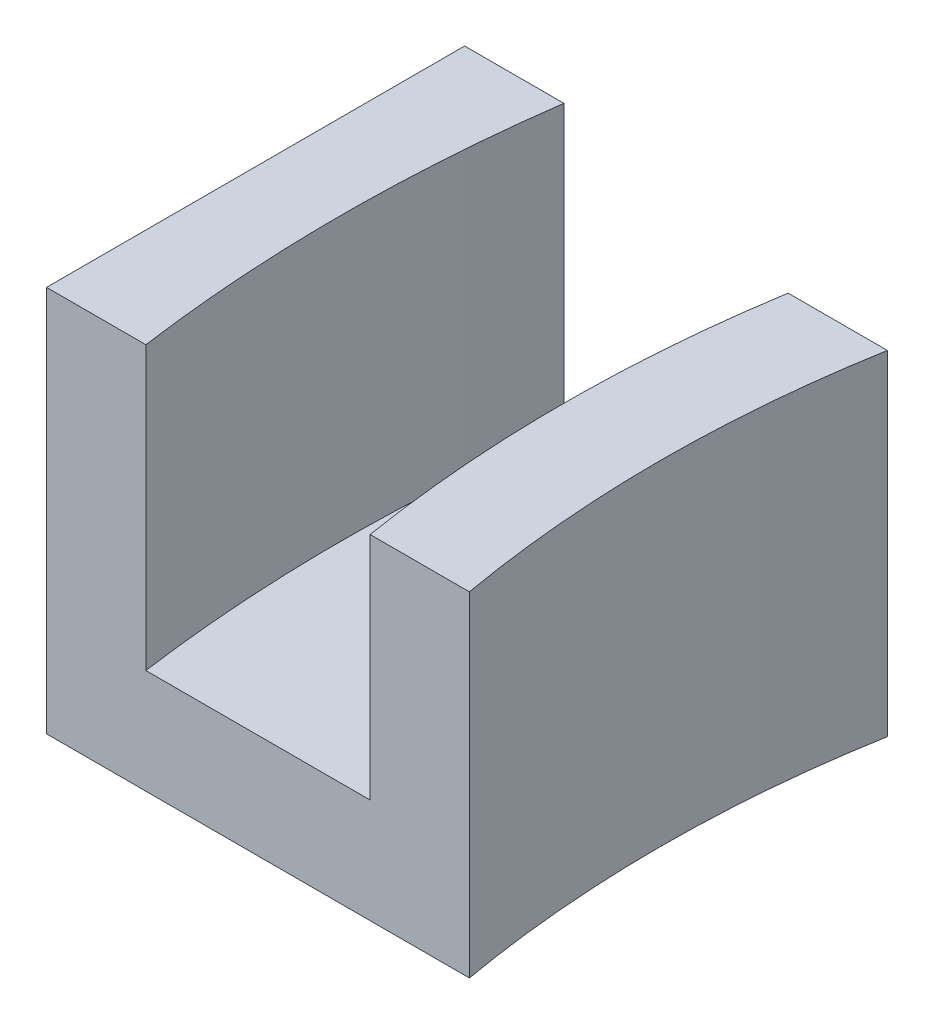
ISO-10303-21;
HEADER;
FILE_DESCRIPTION(('STEP AP214'),'2;1');
FILE_NAME('part.step','',(''),(''),'','','');
FILE_SCHEMA(('AUTOMOTIVE_DESIGN { 1 0 10303 214 1 1 1 1 }'));
ENDSEC;
DATA;
#1=APPLICATION_CONTEXT('core data for automotive mechanical design processes');
#2=APPLICATION_PROTOCOL_DEFINITION('international standard','automotive_design',2000,#1);
#3=PRODUCT_CONTEXT('',#1,'mechanical');
#4=PRODUCT('Part','Part','',(#3));
#5=PRODUCT_RELATED_PRODUCT_CATEGORY('part','',(#4));
#6=PRODUCT_DEFINITION_FORMATION('','',#4);
#7=PRODUCT_DEFINITION_CONTEXT('part definition',#1,'design');
#8=PRODUCT_DEFINITION('design','',#6,#7);
#9=PRODUCT_DEFINITION_SHAPE('','',#8);
#10=(LENGTH_UNIT() NAMED_UNIT(*) SI_UNIT(.MILLI.,.METRE.));
#11=(NAMED_UNIT(*) PLANE_ANGLE_UNIT() SI_UNIT($,.RADIAN.));
#12=(NAMED_UNIT(*) SI_UNIT($,.STERADIAN.) SOLID_ANGLE_UNIT());
#13=UNCERTAINTY_MEASURE_WITH_UNIT(LENGTH_MEASURE(1.E-05),#10,'distance_accuracy_value','');
#14=(GEOMETRIC_REPRESENTATION_CONTEXT(3) GLOBAL_UNCERTAINTY_ASSIGNED_CONTEXT((#13)) GLOBAL_UNIT_ASSIGNED_CONTEXT((#10,
#11,#12)) REPRESENTATION_CONTEXT('',''));
#15=CARTESIAN_POINT('',(0.,0.,0.));
#16=DIRECTION('',(0.,0.,1.));
#17=DIRECTION('',(1.,0.,0.));
#18=AXIS2_PLACEMENT_3D('',#15,#16,#17);
#19=CARTESIAN_POINT('',(0.,37.,-125.));
#20=DIRECTION('',(0.,-1.,0.));
#21=DIRECTION('',(0.,0.,-1.));
#22=AXIS2_PLACEMENT_3D('',#19,#20,#21);
#23=CYLINDRICAL_SURFACE('',#22,145.);
#24=CARTESIAN_POINT('',(0.,10.,-125.));
#25=DIRECTION('',(0.,1.,0.));
#26=DIRECTION('',(0.,0.,1.));
#27=AXIS2_PLACEMENT_3D('',#24,#25,#26);
#28=CIRCLE('',#27,145.);
#29=CARTESIAN_POINT('',(-143.614066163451,10.,-145.));
#30=VERTEX_POINT('',#29);
#31=CARTESIAN_POINT('',(-143.614066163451,10.,-105.));
#32=VERTEX_POINT('',#31);
#33=EDGE_CURVE('E149',#30,#32,#28,.T.);
#34=ORIENTED_EDGE('',*,*,#33,.F.);
#35=DIRECTION('',(0.,-1.,0.));
#36=VECTOR('',#35,1.);
#37=CARTESIAN_POINT('',(-143.614066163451,37.,-145.));
#38=LINE('',#37,#36);
#39=CARTESIAN_POINT('',(-143.614066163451,37.,-145.));
#40=VERTEX_POINT('',#39);
#41=EDGE_CURVE('E11',#40,#30,#38,.T.);
#42=ORIENTED_EDGE('',*,*,#41,.F.);
#43=CARTESIAN_POINT('',(0.,37.,-125.));
#44=DIRECTION('',(0.,1.,0.));
#45=DIRECTION('',(0.,0.,1.));
#46=AXIS2_PLACEMENT_3D('',#43,#44,#45);
#47=CIRCLE('',#46,145.);
#48=CARTESIAN_POINT('',(-143.614066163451,37.,-105.));
#49=VERTEX_POINT('',#48);
#50=EDGE_CURVE('E100',#40,#49,#47,.T.);
#51=ORIENTED_EDGE('',*,*,#50,.T.);
#52=DIRECTION('',(0.,-1.,0.));
#53=VECTOR('',#52,1.);
#54=CARTESIAN_POINT('',(-143.614066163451,37.,-105.));
#55=LINE('',#54,#53);
#56=EDGE_CURVE('E61',#49,#32,#55,.T.);
#57=ORIENTED_EDGE('',*,*,#56,.T.);
#58=EDGE_LOOP('',(#34,#42,#51,#57));
#59=FACE_BOUND('',#58,.T.);
#60=ADVANCED_FACE('F45',(#59),#23,.F.);
#61=CARTESIAN_POINT('',(0.,37.,-145.));
#62=DIRECTION('',(0.,0.,1.));
#63=DIRECTION('',(1.,0.,0.));
#64=AXIS2_PLACEMENT_3D('',#61,#62,#63);
#65=PLANE('',#64);
#66=DIRECTION('',(-1.,0.,0.));
#67=VECTOR('',#66,1.);
#68=CARTESIAN_POINT('',(0.,0.,-145.));
#69=LINE('',#68,#67);
#70=CARTESIAN_POINT('',(-112.657321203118,0.,-145.));
#71=VERTEX_POINT('',#70);
#72=CARTESIAN_POINT('',(-153.114066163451,0.,-145.));
#73=VERTEX_POINT('',#72);
#74=EDGE_CURVE('E105',#71,#73,#69,.T.);
#75=ORIENTED_EDGE('',*,*,#74,.T.);
#76=DIRECTION('',(0.,-1.,0.));
#77=VECTOR('',#76,1.);
#78=CARTESIAN_POINT('',(-153.114066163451,37.,-145.));
#79=LINE('',#78,#77);
#80=CARTESIAN_POINT('',(-153.114066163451,37.,-145.));
#81=VERTEX_POINT('',#80);
#82=EDGE_CURVE('E53',#81,#73,#79,.T.);
#83=ORIENTED_EDGE('',*,*,#82,.F.);
#84=DIRECTION('',(-1.,0.,0.));
#85=VECTOR('',#84,1.);
#86=CARTESIAN_POINT('',(0.,37.,-145.));
#87=LINE('',#86,#85);
#88=EDGE_CURVE('E96',#40,#81,#87,.T.);
#89=ORIENTED_EDGE('',*,*,#88,.F.);
#90=ORIENTED_EDGE('',*,*,#41,.T.);
#91=DIRECTION('',(1.,0.,0.));
#92=VECTOR('',#91,1.);
#93=CARTESIAN_POINT('',(0.,10.,-145.));
#94=LINE('',#93,#92);
#95=CARTESIAN_POINT('',(-122.157321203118,10.,-145.));
#96=VERTEX_POINT('',#95);
#97=EDGE_CURVE('E83',#30,#96,#94,.T.);
#98=ORIENTED_EDGE('',*,*,#97,.T.);
#99=DIRECTION('',(0.,-1.,0.));
#100=VECTOR('',#99,1.);
#101=CARTESIAN_POINT('',(-122.157321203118,32.,-145.));
#102=LINE('',#101,#100);
#103=CARTESIAN_POINT('',(-122.157321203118,32.,-145.));
#104=VERTEX_POINT('',#103);
#105=EDGE_CURVE('E151',#104,#96,#102,.T.);
#106=ORIENTED_EDGE('',*,*,#105,.F.);
#107=DIRECTION('',(1.,0.,0.));
#108=VECTOR('',#107,1.);
#109=CARTESIAN_POINT('',(8.472754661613E-13,32.,-144.999999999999));
#110=LINE('',#109,#108);
#111=CARTESIAN_POINT('',(-112.657321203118,32.,-145.));
#112=VERTEX_POINT('',#111);
#113=EDGE_CURVE('E178',#104,#112,#110,.T.);
#114=ORIENTED_EDGE('',*,*,#113,.T.);
#115=DIRECTION('',(0.,-1.,0.));
#116=VECTOR('',#115,1.);
#117=CARTESIAN_POINT('',(-112.657321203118,32.,-145.));
#118=LINE('',#117,#116);
#119=EDGE_CURVE('E147',#112,#71,#118,.T.);
#120=ORIENTED_EDGE('',*,*,#119,.T.);
#121=EDGE_LOOP('',(#75,#83,#89,#90,#98,#106,#114,#120));
#122=FACE_BOUND('',#121,.T.);
#123=ADVANCED_FACE('F102',(#122),#65,.F.);
#124=CARTESIAN_POINT('',(-153.114066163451,37.,0.));
#125=DIRECTION('',(-1.,0.,0.));
#126=DIRECTION('',(0.,0.,1.));
#127=AXIS2_PLACEMENT_3D('',#124,#125,#126);
#128=PLANE('',#127);
#129=DIRECTION('',(0.,0.,-1.));
#130=VECTOR('',#129,1.);
#131=CARTESIAN_POINT('',(-153.114066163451,0.,0.));
#132=LINE('',#131,#130);
#133=CARTESIAN_POINT('',(-153.114066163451,0.,-105.));
#134=VERTEX_POINT('',#133);
#135=EDGE_CURVE('E115',#134,#73,#132,.T.);
#136=ORIENTED_EDGE('',*,*,#135,.F.);
#137=DIRECTION('',(0.,-1.,0.));
#138=VECTOR('',#137,1.);
#139=CARTESIAN_POINT('',(-153.114066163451,37.,-105.));
#140=LINE('',#139,#138);
#141=CARTESIAN_POINT('',(-153.114066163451,37.,-105.));
#142=VERTEX_POINT('',#141);
#143=EDGE_CURVE('E107',#142,#134,#140,.T.);
#144=ORIENTED_EDGE('',*,*,#143,.F.);
#145=DIRECTION('',(0.,0.,-1.));
#146=VECTOR('',#145,1.);
#147=CARTESIAN_POINT('',(-153.114066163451,37.,0.));
#148=LINE('',#147,#146);
#149=EDGE_CURVE('E99',#142,#81,#148,.T.);
#150=ORIENTED_EDGE('',*,*,#149,.T.);
#151=ORIENTED_EDGE('',*,*,#82,.T.);
#152=EDGE_LOOP('',(#136,#144,#150,#151));
#153=FACE_BOUND('',#152,.T.);
#154=ADVANCED_FACE('F108',(#153),#128,.T.);
#155=CARTESIAN_POINT('',(0.,37.,-105.));
#156=DIRECTION('',(0.,0.,1.));
#157=DIRECTION('',(1.,0.,0.));
#158=AXIS2_PLACEMENT_3D('',#155,#156,#157);
#159=PLANE('',#158);
#160=DIRECTION('',(-1.,0.,0.));
#161=VECTOR('',#160,1.);
#162=CARTESIAN_POINT('',(0.,0.,-105.));
#163=LINE('',#162,#161);
#164=CARTESIAN_POINT('',(-112.657321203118,0.,-105.));
#165=VERTEX_POINT('',#164);
#166=EDGE_CURVE('E118',#165,#134,#163,.T.);
#167=ORIENTED_EDGE('',*,*,#166,.F.);
#168=DIRECTION('',(0.,-1.,0.));
#169=VECTOR('',#168,1.);
#170=CARTESIAN_POINT('',(-112.657321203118,32.,-105.));
#171=LINE('',#170,#169);
#172=CARTESIAN_POINT('',(-112.657321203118,32.,-105.));
#173=VERTEX_POINT('',#172);
#174=EDGE_CURVE('E140',#173,#165,#171,.T.);
#175=ORIENTED_EDGE('',*,*,#174,.F.);
#176=DIRECTION('',(1.,0.,0.));
#177=VECTOR('',#176,1.);
#178=CARTESIAN_POINT('',(-3.06772151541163E-13,32.,-105.));
#179=LINE('',#178,#177);
#180=CARTESIAN_POINT('',(-122.157321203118,32.,-105.));
#181=VERTEX_POINT('',#180);
#182=EDGE_CURVE('E136',#181,#173,#179,.T.);
#183=ORIENTED_EDGE('',*,*,#182,.F.);
#184=DIRECTION('',(0.,-1.,0.));
#185=VECTOR('',#184,1.);
#186=CARTESIAN_POINT('',(-122.157321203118,32.,-105.));
#187=LINE('',#186,#185);
#188=CARTESIAN_POINT('',(-122.157321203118,10.,-105.));
#189=VERTEX_POINT('',#188);
#190=EDGE_CURVE('E184',#181,#189,#187,.T.);
#191=ORIENTED_EDGE('',*,*,#190,.T.);
#192=DIRECTION('',(1.,0.,0.));
#193=VECTOR('',#192,1.);
#194=CARTESIAN_POINT('',(0.,10.,-105.));
#195=LINE('',#194,#193);
#196=EDGE_CURVE('E156',#32,#189,#195,.T.);
#197=ORIENTED_EDGE('',*,*,#196,.F.);
#198=ORIENTED_EDGE('',*,*,#56,.F.);
#199=DIRECTION('',(-1.,0.,0.));
#200=VECTOR('',#199,1.);
#201=CARTESIAN_POINT('',(0.,37.,-105.));
#202=LINE('',#201,#200);
#203=EDGE_CURVE('E109',#49,#142,#202,.T.);
#204=ORIENTED_EDGE('',*,*,#203,.T.);
#205=ORIENTED_EDGE('',*,*,#143,.T.);
#206=EDGE_LOOP('',(#167,#175,#183,#191,#197,#198,#204,#205));
#207=FACE_BOUND('',#206,.T.);
#208=ADVANCED_FACE('F123',(#207),#159,.T.);
#209=CARTESIAN_POINT('',(0.,37.,0.));
#210=DIRECTION('',(0.,1.,0.));
#211=DIRECTION('',(0.,0.,1.));
#212=AXIS2_PLACEMENT_3D('',#209,#210,#211);
#213=PLANE('',#212);
#214=ORIENTED_EDGE('',*,*,#50,.F.);
#215=ORIENTED_EDGE('',*,*,#88,.T.);
#216=ORIENTED_EDGE('',*,*,#149,.F.);
#217=ORIENTED_EDGE('',*,*,#203,.F.);
#218=EDGE_LOOP('',(#214,#215,#216,#217));
#219=FACE_BOUND('',#218,.T.);
#220=ADVANCED_FACE('F97',(#219),#213,.T.);
#221=CARTESIAN_POINT('',(0.,0.,0.));
#222=DIRECTION('',(0.,1.,0.));
#223=DIRECTION('',(0.,0.,1.));
#224=AXIS2_PLACEMENT_3D('',#221,#222,#223);
#225=PLANE('',#224);
#226=CARTESIAN_POINT('',(-133.114066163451,0.,-125.));
#227=DIRECTION('',(0.,-1.,0.));
#228=DIRECTION('',(0.,0.,-1.));
#229=AXIS2_PLACEMENT_3D('',#226,#227,#228);
#230=CIRCLE('',#229,1.40000000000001);
#231=CARTESIAN_POINT('',(-133.114066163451,0.,-126.4));
#232=VERTEX_POINT('',#231);
#233=EDGE_CURVE('E193',#232,#232,#230,.T.);
#234=ORIENTED_EDGE('',*,*,#233,.F.);
#235=EDGE_LOOP('',(#234));
#236=FACE_BOUND('',#235,.T.);
#237=ORIENTED_EDGE('',*,*,#74,.F.);
#238=CARTESIAN_POINT('',(0.590195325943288,0.,-125.));
#239=DIRECTION('',(0.,1.,0.));
#240=DIRECTION('',(0.,0.,1.));
#241=AXIS2_PLACEMENT_3D('',#238,#239,#240);
#242=CIRCLE('',#241,115.);
#243=EDGE_CURVE('E130',#165,#71,#242,.F.);
#244=ORIENTED_EDGE('',*,*,#243,.F.);
#245=ORIENTED_EDGE('',*,*,#166,.T.);
#246=ORIENTED_EDGE('',*,*,#135,.T.);
#247=EDGE_LOOP('',(#237,#244,#245,#246));
#248=FACE_BOUND('',#247,.T.);
#249=ADVANCED_FACE('F128',(#236,#248),#225,.F.);
#250=CARTESIAN_POINT('',(0.,10.,0.));
#251=DIRECTION('',(0.,1.,0.));
#252=DIRECTION('',(0.,0.,1.));
#253=AXIS2_PLACEMENT_3D('',#250,#251,#252);
#254=PLANE('',#253);
#255=CARTESIAN_POINT('',(-133.114066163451,10.,-125.));
#256=DIRECTION('',(0.,-1.,0.));
#257=DIRECTION('',(0.,0.,-1.));
#258=AXIS2_PLACEMENT_3D('',#255,#256,#257);
#259=CIRCLE('',#258,1.40000000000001);
#260=CARTESIAN_POINT('',(-133.114066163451,10.,-126.4));
#261=VERTEX_POINT('',#260);
#262=EDGE_CURVE('E137',#261,#261,#259,.T.);
#263=ORIENTED_EDGE('',*,*,#262,.T.);
#264=EDGE_LOOP('',(#263));
#265=FACE_BOUND('',#264,.T.);
#266=ORIENTED_EDGE('',*,*,#97,.F.);
#267=ORIENTED_EDGE('',*,*,#33,.T.);
#268=ORIENTED_EDGE('',*,*,#196,.T.);
#269=CARTESIAN_POINT('',(1.2323055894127,10.,-125.));
#270=DIRECTION('',(0.,1.,0.));
#271=DIRECTION('',(0.,0.,1.));
#272=AXIS2_PLACEMENT_3D('',#269,#270,#271);
#273=CIRCLE('',#272,125.);
#274=EDGE_CURVE('E116',#96,#189,#273,.T.);
#275=ORIENTED_EDGE('',*,*,#274,.F.);
#276=EDGE_LOOP('',(#266,#267,#268,#275));
#277=FACE_BOUND('',#276,.T.);
#278=ADVANCED_FACE('F199',(#265,#277),#254,.T.);
#279=CARTESIAN_POINT('',(0.590195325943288,32.,-125.));
#280=DIRECTION('',(0.,-1.,0.));
#281=DIRECTION('',(0.,0.,-1.));
#282=AXIS2_PLACEMENT_3D('',#279,#280,#281);
#283=CYLINDRICAL_SURFACE('',#282,115.);
#284=ORIENTED_EDGE('',*,*,#243,.T.);
#285=ORIENTED_EDGE('',*,*,#119,.F.);
#286=CARTESIAN_POINT('',(0.590195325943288,32.,-125.));
#287=DIRECTION('',(0.,1.,0.));
#288=DIRECTION('',(0.,0.,1.));
#289=AXIS2_PLACEMENT_3D('',#286,#287,#288);
#290=CIRCLE('',#289,115.);
#291=EDGE_CURVE('E144',#173,#112,#290,.F.);
#292=ORIENTED_EDGE('',*,*,#291,.F.);
#293=ORIENTED_EDGE('',*,*,#174,.T.);
#294=EDGE_LOOP('',(#284,#285,#292,#293));
#295=FACE_BOUND('',#294,.T.);
#296=ADVANCED_FACE('F141',(#295),#283,.F.);
#297=CARTESIAN_POINT('',(1.2323055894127,32.,-125.));
#298=DIRECTION('',(0.,-1.,0.));
#299=DIRECTION('',(0.,0.,-1.));
#300=AXIS2_PLACEMENT_3D('',#297,#298,#299);
#301=CYLINDRICAL_SURFACE('',#300,125.);
#302=ORIENTED_EDGE('',*,*,#274,.T.);
#303=ORIENTED_EDGE('',*,*,#190,.F.);
#304=CARTESIAN_POINT('',(1.2323055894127,32.,-125.));
#305=DIRECTION('',(0.,1.,0.));
#306=DIRECTION('',(0.,0.,1.));
#307=AXIS2_PLACEMENT_3D('',#304,#305,#306);
#308=CIRCLE('',#307,125.);
#309=EDGE_CURVE('E182',#104,#181,#308,.T.);
#310=ORIENTED_EDGE('',*,*,#309,.F.);
#311=ORIENTED_EDGE('',*,*,#105,.T.);
#312=EDGE_LOOP('',(#302,#303,#310,#311));
#313=FACE_BOUND('',#312,.T.);
#314=ADVANCED_FACE('F190',(#313),#301,.T.);
#315=CARTESIAN_POINT('',(0.,32.,0.));
#316=DIRECTION('',(0.,1.,0.));
#317=DIRECTION('',(0.,0.,1.));
#318=AXIS2_PLACEMENT_3D('',#315,#316,#317);
#319=PLANE('',#318);
#320=ORIENTED_EDGE('',*,*,#182,.T.);
#321=ORIENTED_EDGE('',*,*,#291,.T.);
#322=ORIENTED_EDGE('',*,*,#113,.F.);
#323=ORIENTED_EDGE('',*,*,#309,.T.);
#324=EDGE_LOOP('',(#320,#321,#322,#323));
#325=FACE_BOUND('',#324,.T.);
#326=ADVANCED_FACE('F176',(#325),#319,.T.);
#327=CARTESIAN_POINT('',(-133.114066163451,10.,-125.));
#328=DIRECTION('',(0.,-1.,0.));
#329=DIRECTION('',(0.,0.,-1.));
#330=AXIS2_PLACEMENT_3D('',#327,#328,#329);
#331=CYLINDRICAL_SURFACE('',#330,1.40000000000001);
#332=ORIENTED_EDGE('',*,*,#262,.F.);
#333=EDGE_LOOP('',(#332));
#334=FACE_BOUND('',#333,.T.);
#335=ORIENTED_EDGE('',*,*,#233,.T.);
#336=EDGE_LOOP('',(#335));
#337=FACE_BOUND('',#336,.T.);
#338=ADVANCED_FACE('F201',(#334,#337),#331,.F.);
#339=CLOSED_SHELL('',(#60,#123,#154,#208,#220,#249,#278,#296,#314,#326,#338));
#340=MANIFOLD_SOLID_BREP('B2',#339);
#341=ADVANCED_BREP_SHAPE_REPRESENTATION('',(#18,#340),#14);
#342=SHAPE_DEFINITION_REPRESENTATION(#9,#341);
ENDSEC;
END-ISO-10303-21;
